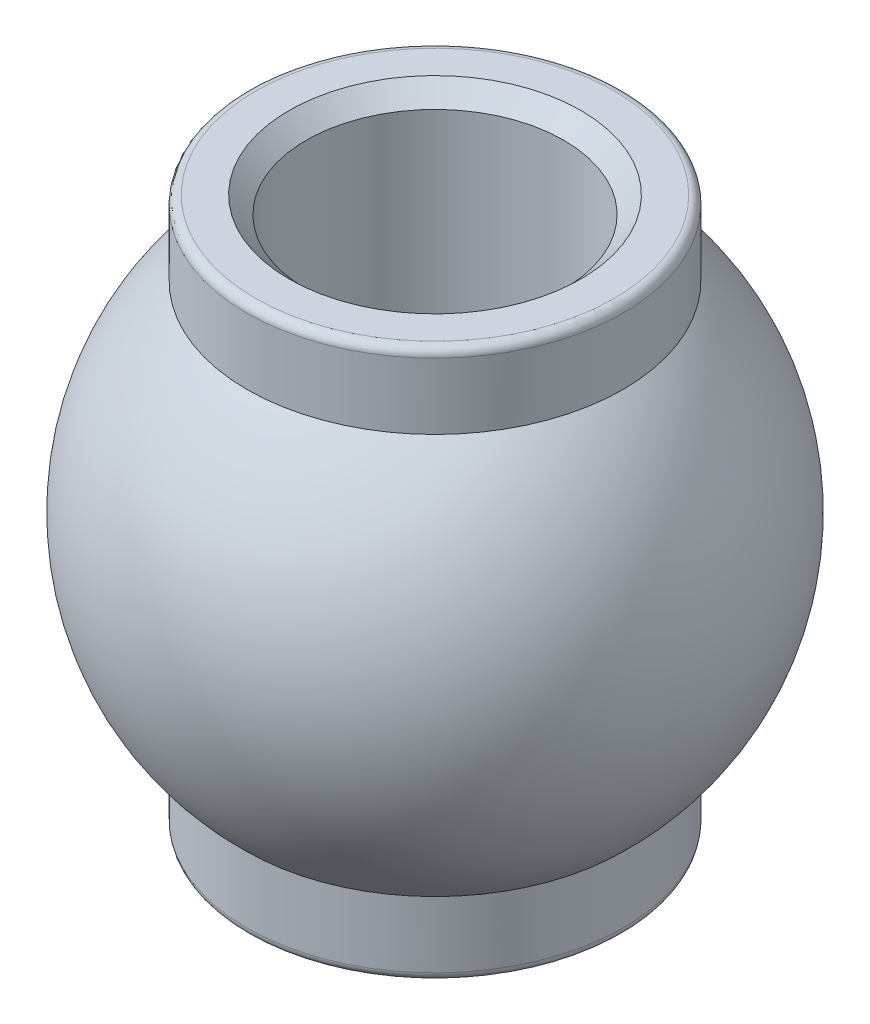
from build123d import *

# Parameters (mm, degrees)
CHANFREIN1_SIZE = 1


with BuildPart() as part:
    # Esquisse1 → Base-R_volution (revolve)
    with BuildSketch(Plane.XY, mode=Mode.PRIVATE) as base_r_volution_sk:
        with BuildLine():
            Line((7.5, 16), (7.5, -16))
            Line((7.5, -16), (10.45, -16))
            ThreePointArc((10.45, -16), (10.803553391, -15.853553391), (10.95, -15.5))
            Line((10.95, -15.5), (10.95, -11.652364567))
            ThreePointArc((10.95, -11.652364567), (15.99, 0), (10.95, 11.652364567))
            Line((10.95, 11.652364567), (10.95, 15.5))
            ThreePointArc((10.95, 15.5), (10.803553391, 15.853553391), (10.45, 16))
            Line((10.45, 16), (7.5, 16))
        make_face()
    revolve(base_r_volution_sk.sketch.rotate(Axis((0, 27, 0), (0, -1, 0)), 90), axis=Axis((0, 27, 0), (0, -1, 0)))

    # Chanfrein1
    chanfrein1_edges = [part.edges().sort_by_distance(p)[0] for p in [
        (0, 16, -7.5),
        (0, -16, -7.5),
    ]]
    chamfer(chanfrein1_edges, length=CHANFREIN1_SIZE)


solid = part.part
